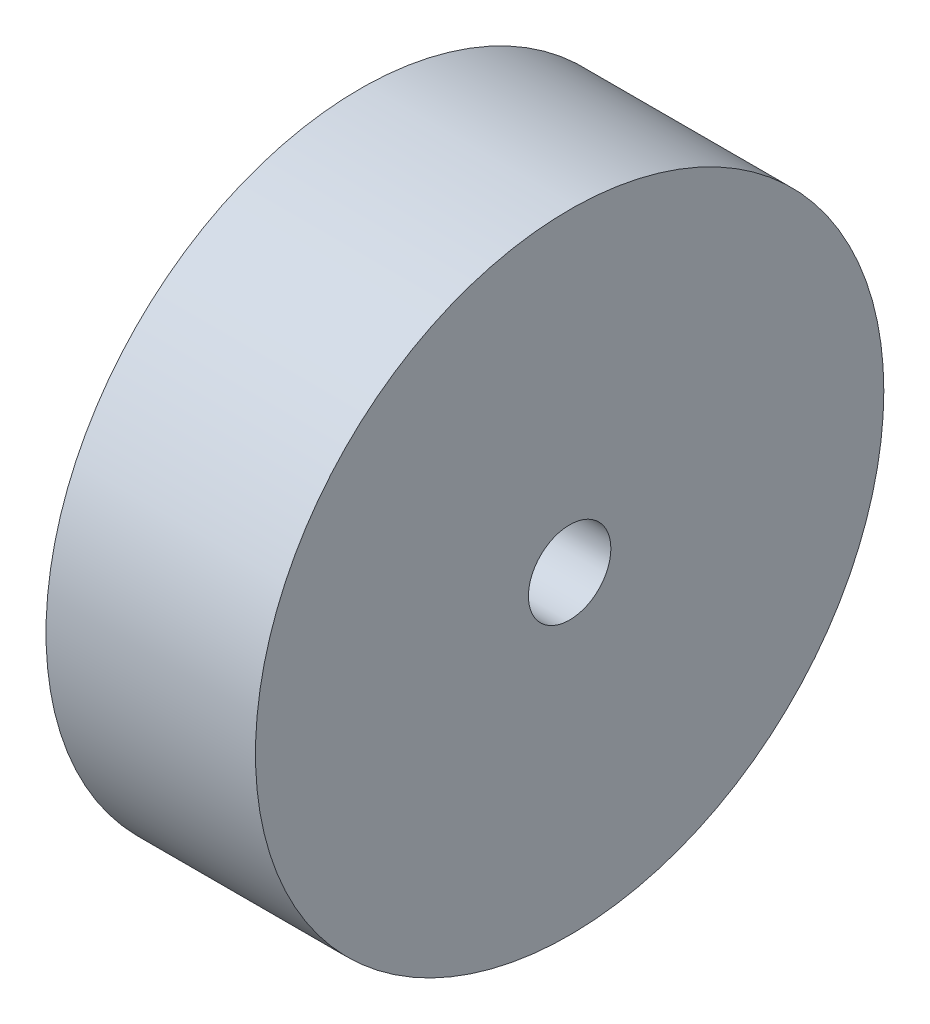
from build123d import *

# Parameters (mm, degrees)
SKETCH1_R           = 38.1
SKETCH1_R_2         = 5
BOSS_EXTRUDE1_DEPTH = 25.4


with BuildPart() as part:
    # Sketch1 → Boss-Extrude1 (new body)
    with BuildSketch(Plane(origin=(0, 0, 0), x_dir=(0, 0, -1), z_dir=(1, 0, 0))):
        Circle(SKETCH1_R)
        Circle(SKETCH1_R_2, mode=Mode.SUBTRACT)
    extrude(amount=BOSS_EXTRUDE1_DEPTH)


solid = part.part
